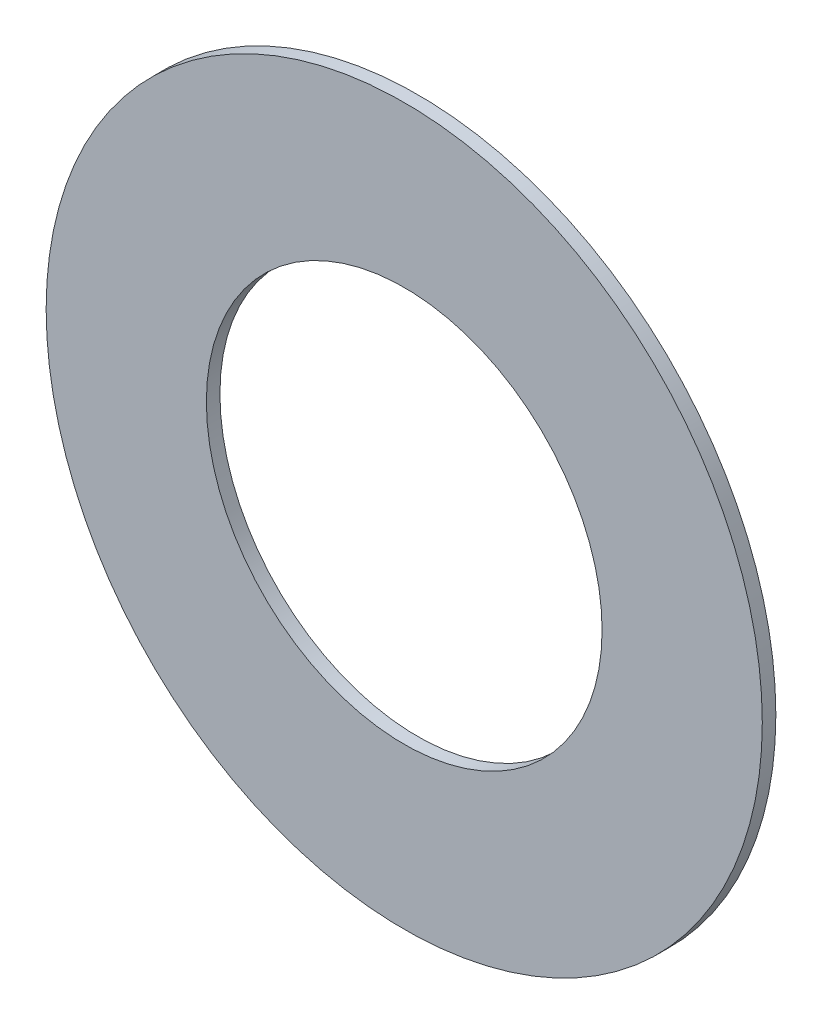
from build123d import *

# Parameters (mm, degrees)
SKETCH2_R           = 83.889584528
SKETCH2_R_2         = 46.355
BOSS_EXTRUDE1_DEPTH = 1.5875


with BuildPart() as part:
    # Sketch2 → Boss-Extrude1 (new, symmetric)
    with BuildSketch(Plane(origin=(0, 0, 0), x_dir=(0, 1, 0), z_dir=(0, 0, 1))):
        with Locations(Location((0, 0, 0), (0, 0, 270))):
            Circle(SKETCH2_R)
        with Locations(Location((0, 0, 0), (0, 0, 270))):
            Circle(SKETCH2_R_2, mode=Mode.SUBTRACT)
    extrude(amount=BOSS_EXTRUDE1_DEPTH, both=True)


solid = part.part
